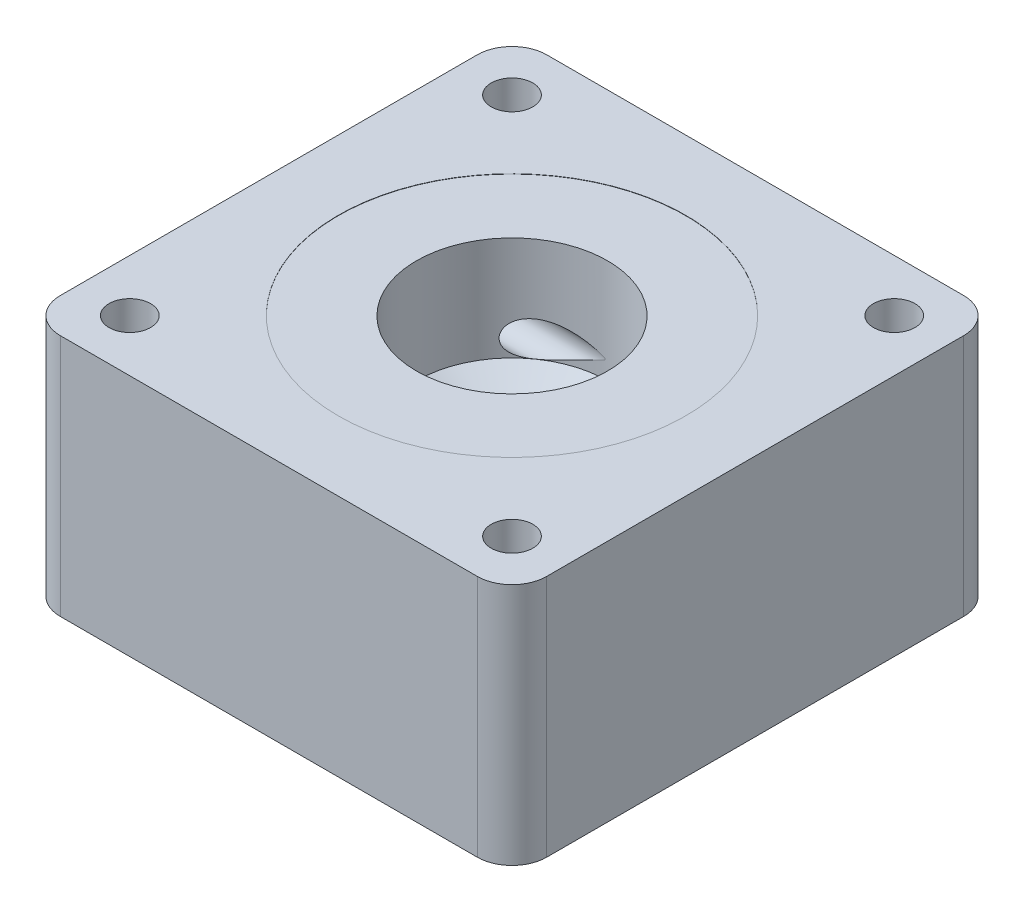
from build123d import *

# Parameters (mm, degrees)
SKETCH1_W                                         = 44.45
SKETCH1_H                                         = 44.45
BOSS_EXTRUDE1_DEPTH                               = 22.225
CSK_FOR_6_FLAT_HEAD_SOCKET_CAP_SCREW1_D           = 3.7973
CSK_FOR_6_FLAT_HEAD_SOCKET_CAP_SCREW1_CSINK_D     = 7.7978
CSK_FOR_6_FLAT_HEAD_SOCKET_CAP_SCREW1_CSINK_ANGLE = 82
F_11_16_0_6875_DIAMETER_HOLE1_D                   = 17.4625
F_11_16_0_6875_DIAMETER_HOLE1_DEPTH               = 9.525
F_11_16_0_6875_DIAMETER_HOLE1_TIP                 = 5.24626428
SKETCH220_R                                       = 15.875
CUT_EXTRUDE1_DEPTH                                = 0.0254
FILLET1_R                                         = 3.175
F_1_4_28_TAPPED_HOLE1_D                           = 5.4102
F_1_4_28_TAPPED_HOLE1_DEPTH                       = 8.89
SKETCH232_R                                       = 1.5875
CUT_EXTRUDE2_DEPTH                                = 13.09624


with BuildPart() as part:
    # Sketch1 → Boss-Extrude1 (new body)
    with BuildSketch(Plane(origin=(0, 0, 0), x_dir=(1, 0, 0), z_dir=(0, 1, 0))):
        with Locations((22.225, 22.225)):
            Rectangle(SKETCH1_W, SKETCH1_H)
    extrude(amount=BOSS_EXTRUDE1_DEPTH)

    # CSK for _6 Flat Head Socket Cap Screw1 (through all)
    with Locations(Plane(origin=(11.910034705, 0, -3.981367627), x_dir=(-1, 0, 0), z_dir=(0, -1, 0))):
        with Locations((-27.777465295, 35.706132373), (7.147534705, 35.706132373), (-27.777465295, 0.781132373), (7.147534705, 0.781132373)):
            CounterSinkHole(CSK_FOR_6_FLAT_HEAD_SOCKET_CAP_SCREW1_D / 2, CSK_FOR_6_FLAT_HEAD_SOCKET_CAP_SCREW1_CSINK_D / 2, counter_sink_angle=CSK_FOR_6_FLAT_HEAD_SOCKET_CAP_SCREW1_CSINK_ANGLE)

    # 11_16 _0.6875_ Diameter Hole1
    with Locations(Plane(origin=(0, 22.225, 0), x_dir=(-1, 0, 0), z_dir=(0, 1, 0))):
        with Locations((-22.225, -22.225)):
            Hole(F_11_16_0_6875_DIAMETER_HOLE1_D / 2, depth=F_11_16_0_6875_DIAMETER_HOLE1_DEPTH)
            with Locations((0, 0, -(F_11_16_0_6875_DIAMETER_HOLE1_DEPTH + F_11_16_0_6875_DIAMETER_HOLE1_TIP / 2))):  # 118° drill point
                Cone(0, F_11_16_0_6875_DIAMETER_HOLE1_D / 2, F_11_16_0_6875_DIAMETER_HOLE1_TIP, mode=Mode.SUBTRACT)

    # Sketch220 → Cut-Extrude1 (cut)
    with BuildSketch(Plane(origin=(0, 22.225, 0), x_dir=(1, 0, 0), z_dir=(0, 1, 0))):
        with Locations(Location((22.225, 22.225, 0), (0, 0, 270))):
            Circle(SKETCH220_R)
    extrude(amount=-CUT_EXTRUDE1_DEPTH, mode=Mode.SUBTRACT)

    # Fillet1
    fillet1_edges = [part.edges().sort_by_distance(p)[0] for p in [
        (0, 11.1125, -44.45),
        (44.45, 11.1125, -44.45),
        (44.45, 11.1125, 0),
        (0, 11.1125, 0),
    ]]
    fillet(fillet1_edges, radius=FILLET1_R)

    # Port Sketch → SAE Port (revolve, cut)
    with BuildSketch(Plane(origin=(19.167680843, 0, -22.225), x_dir=(1, 0, 0), z_dir=(0, 0, 1)), mode=Mode.PRIVATE) as sae_port_sk:
        with BuildLine():
            Line((3.058324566, 18.580641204), (8.018944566, 15.6))
            Line((8.018944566, 15.6), (8.018944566, 13.1))
            Line((8.018944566, 13.1), (8.614574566, 13.1))
            Line((8.614574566, 13.1), (8.614574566, 4.110417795))
            Line((8.614574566, 4.110417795), (8.524992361, 4.2))
            Line((8.524992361, 4.2), (9.034875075, 1.801190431))
            ThreePointArc((9.034875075, 1.801190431), (9.123477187, 1.656604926), (9.283324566, 1.6))
            Line((9.283324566, 1.6), (13.558324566, 1.6))
            Line((13.558324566, 1.6), (13.558324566, 0))
            Line((13.558324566, 0), (3.058324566, 0))
            Line((3.058324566, 0), (3.058324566, 18.580641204))
        make_face()
    revolve(sae_port_sk.sketch.rotate(Axis((22.226005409, 0, -22.225), (0, 1, 0)), 90), axis=Axis((22.226005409, 0, -22.225), (0, 1, 0)), mode=Mode.SUBTRACT)

    # 1_4-28 Tapped Hole1
    with Locations(Plane.ZY):
        with Locations((-29.36748, 14.2875), (-15.08252, 14.2875)):
            Hole(F_1_4_28_TAPPED_HOLE1_D / 2, depth=F_1_4_28_TAPPED_HOLE1_DEPTH)

    # Sketch232 → Cut-Extrude2 (cut)
    with BuildSketch(Plane.ZY.offset(-8.89)):
        with Locations((-29.36748, 14.2875)):
            Circle(SKETCH232_R)
        with Locations((-15.08252, 14.2875)):
            Circle(SKETCH232_R)
    extrude(amount=-CUT_EXTRUDE2_DEPTH, mode=Mode.SUBTRACT)


solid = part.part
